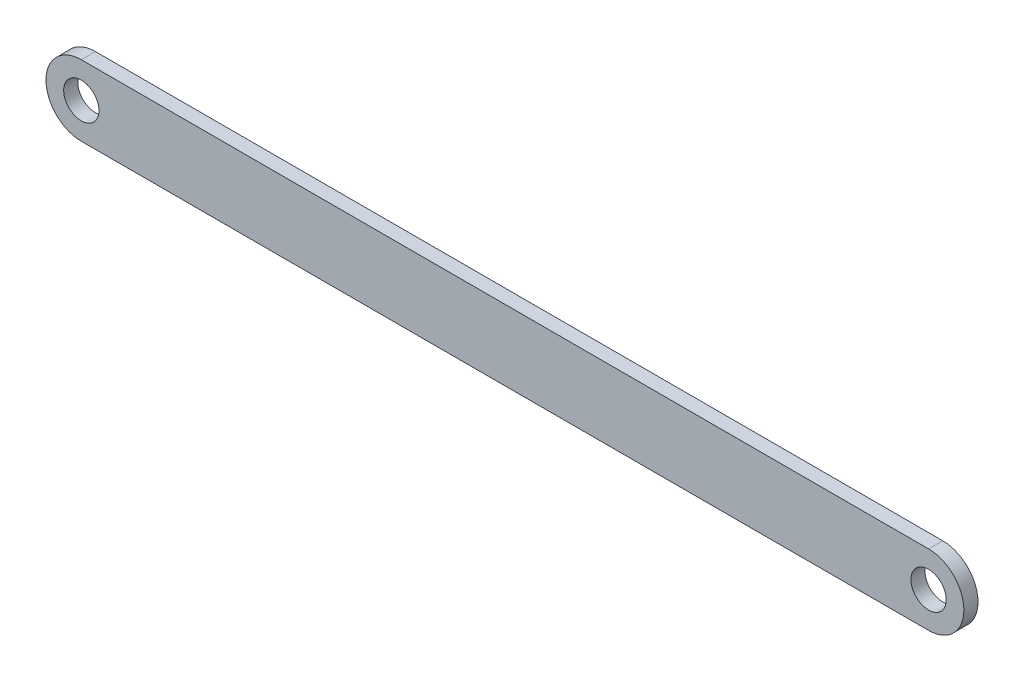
from build123d import *

# Parameters (mm, degrees)
SKETCH2_R           = 3.175
BOSS_EXTRUDE2_DEPTH = 2.54


with BuildPart() as part:
    # Sketch2 → Boss-Extrude2 (new body)
    with BuildSketch(Plane.XY):
        with BuildLine():
            Line((0, 0), (152.4, 0))
            ThreePointArc((152.4, 0), (158.75, 6.35), (152.4, 12.7))
            Line((152.4, 12.7), (0, 12.7))
            ThreePointArc((0, 12.7), (-6.35, 6.35), (0, 0))
        make_face()
        with Locations((0, 6.35)):
            Circle(SKETCH2_R, mode=Mode.SUBTRACT)
        with Locations((152.4, 6.35)):
            Circle(SKETCH2_R, mode=Mode.SUBTRACT)
    extrude(amount=BOSS_EXTRUDE2_DEPTH)


solid = part.part
